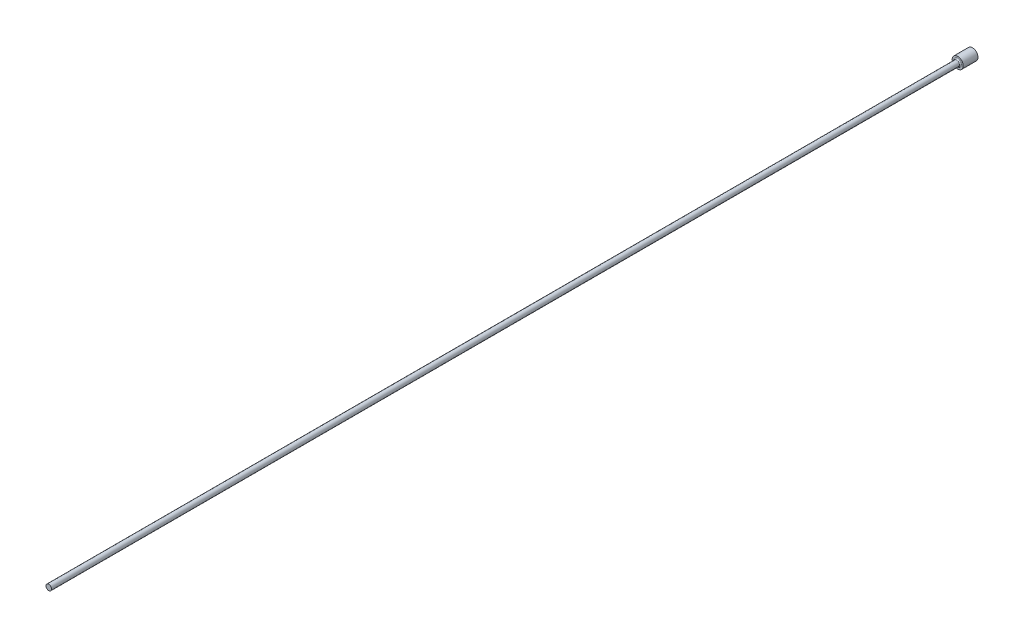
from build123d import *

# Parameters (mm, degrees)
FILLET1_R = 0.3


with BuildPart() as part:
    # FV → Revolve1 (revolve)
    with BuildSketch(Plane(origin=(0, 0, 0), x_dir=(1, 0, 0), z_dir=(0, 1, 0)), mode=Mode.PRIVATE) as revolve1_sk:
        Polygon((0, 0), (1.5, 0), (1.5, -4), (0.75, -4), (0.75, -250), (0, -250), align=None)
    revolve(revolve1_sk.sketch.rotate(Axis((0, 0, -9.033228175), (0, 0, 1)), 180), axis=Axis((0, 0, -9.033228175), (0, 0, 1)))

    # Fillet1
    fillet1_edges = [part.edges().sort_by_distance(p)[0] for p in [
        (0.75, 0, 4),
    ]]
    fillet(fillet1_edges, radius=FILLET1_R)


solid = part.part
